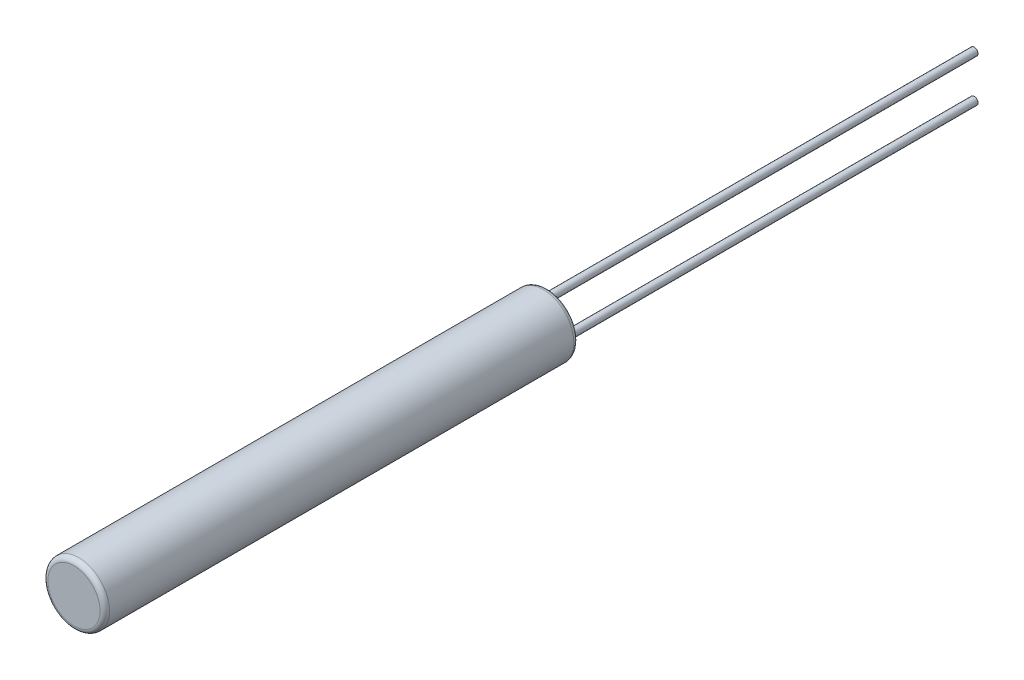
from build123d import *

# Parameters (mm, degrees)
ESQUISSE1_R        = 0.65
BOSS_EXTRU_1_DEPTH = 10
ESQUISSE2_R        = 0.08
BOSS_EXTRU_2_DEPTH = 9
CONG_1_R           = 0.1


with BuildPart() as part:
    # Esquisse1 → Boss.-Extru.1 (new body)
    with BuildSketch(Plane.XY):
        Circle(ESQUISSE1_R)
    extrude(amount=BOSS_EXTRU_1_DEPTH)

    # Esquisse2 → Boss.-Extru.2 (add)
    with BuildSketch(Plane(origin=(0, 0, 0), x_dir=(-1, 0, 0), z_dir=(0, 0, -1))):
        with Locations(Location((0, -0.45, 0), (0, 0, 180))):
            Circle(ESQUISSE2_R)
        with Locations(Location((0, 0.45, 0), (0, 0, 180))):
            Circle(ESQUISSE2_R)
    extrude(amount=BOSS_EXTRU_2_DEPTH)

    # Cong_1
    cong_1_edges = [part.edges().sort_by_distance(p)[0] for p in [
        (-0.65, 0, 0),
        (-0.65, 0, 10),
    ]]
    fillet(cong_1_edges, radius=CONG_1_R)


solid = part.part
